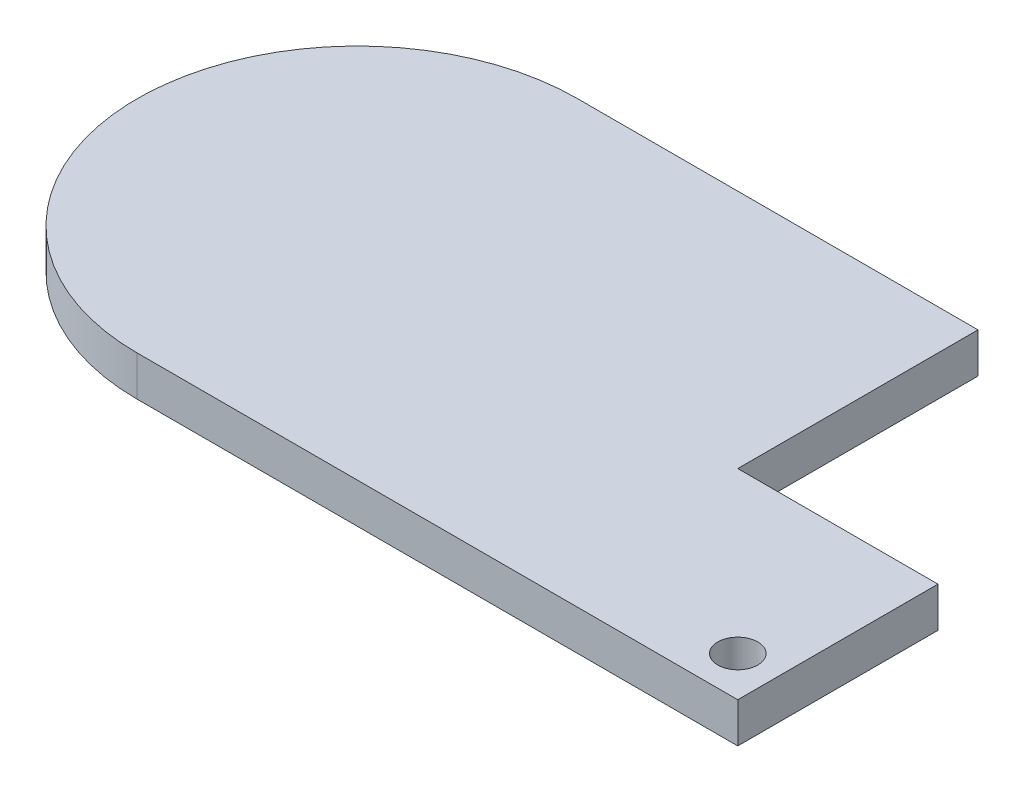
from build123d import *

# Parameters (mm, degrees)
EXTRUDE1_DEPTH     = 10
SKETCH2_R          = 5
CUT_EXTRUDE1_DEPTH = 187.279360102


with BuildPart() as part:
    # Sketch1 → Extrude1 (new body)
    with BuildSketch(Plane(origin=(0, 0, 0), x_dir=(1, 0, 0), z_dir=(0, 1, 0))):
        with BuildLine():
            Line((0, 0), (150, 0))
            Line((150, 0), (150, 50))
            Line((150, 50), (100, 50))
            Line((100, 50), (100, 110))
            Line((100, 110), (0, 110))
            ThreePointArc((0, 110), (-55, 55), (0, 0))
        make_face()
    extrude(amount=EXTRUDE1_DEPTH)

    # Sketch2 → Cut-Extrude1 (cut, through all)
    with BuildSketch(Plane(origin=(0, 10, 0), x_dir=(-1, 0, 0), z_dir=(0, 1, 0))):
        with Locations(Location((-140, -10, 0), (0, 0, 90))):
            Circle(SKETCH2_R)
    extrude(amount=-CUT_EXTRUDE1_DEPTH, mode=Mode.SUBTRACT)


solid = part.part
